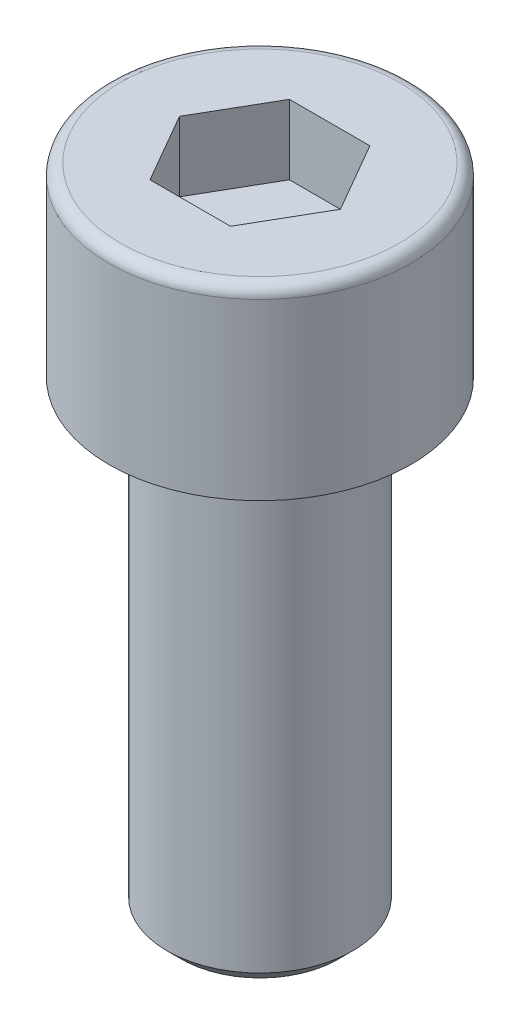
ISO-10303-21;
HEADER;
FILE_DESCRIPTION(('STEP AP214'),'2;1');
FILE_NAME('part.step','',(''),(''),'','','');
FILE_SCHEMA(('AUTOMOTIVE_DESIGN { 1 0 10303 214 1 1 1 1 }'));
ENDSEC;
DATA;
#1=APPLICATION_CONTEXT('core data for automotive mechanical design processes');
#2=APPLICATION_PROTOCOL_DEFINITION('international standard','automotive_design',2000,#1);
#3=PRODUCT_CONTEXT('',#1,'mechanical');
#4=PRODUCT('Part','Part','',(#3));
#5=PRODUCT_RELATED_PRODUCT_CATEGORY('part','',(#4));
#6=PRODUCT_DEFINITION_FORMATION('','',#4);
#7=PRODUCT_DEFINITION_CONTEXT('part definition',#1,'design');
#8=PRODUCT_DEFINITION('design','',#6,#7);
#9=PRODUCT_DEFINITION_SHAPE('','',#8);
#10=(LENGTH_UNIT() NAMED_UNIT(*) SI_UNIT(.MILLI.,.METRE.));
#11=(NAMED_UNIT(*) PLANE_ANGLE_UNIT() SI_UNIT($,.RADIAN.));
#12=(NAMED_UNIT(*) SI_UNIT($,.STERADIAN.) SOLID_ANGLE_UNIT());
#13=UNCERTAINTY_MEASURE_WITH_UNIT(LENGTH_MEASURE(1.E-05),#10,'distance_accuracy_value','');
#14=(GEOMETRIC_REPRESENTATION_CONTEXT(3) GLOBAL_UNCERTAINTY_ASSIGNED_CONTEXT((#13)) GLOBAL_UNIT_ASSIGNED_CONTEXT((#10,
#11,#12)) REPRESENTATION_CONTEXT('',''));
#15=CARTESIAN_POINT('',(0.,0.,0.));
#16=DIRECTION('',(0.,0.,1.));
#17=DIRECTION('',(1.,0.,0.));
#18=AXIS2_PLACEMENT_3D('',#15,#16,#17);
#19=CARTESIAN_POINT('',(-4.00000000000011,0.,4.9960036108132E-13));
#20=DIRECTION('',(0.,-1.,0.));
#21=DIRECTION('',(0.,0.,-1.00000000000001));
#22=AXIS2_PLACEMENT_3D('',#19,#20,#21);
#23=PLANE('',#22);
#24=CARTESIAN_POINT('',(0.,0.,0.));
#25=DIRECTION('',(0.,-1.,0.));
#26=DIRECTION('',(0.,0.,-1.00000000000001));
#27=AXIS2_PLACEMENT_3D('',#24,#25,#26);
#28=CIRCLE('',#27,3.375);
#29=CARTESIAN_POINT('',(0.,0.,-3.37500000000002));
#30=VERTEX_POINT('',#29);
#31=EDGE_CURVE('E11',#30,#30,#28,.T.);
#32=ORIENTED_EDGE('',*,*,#31,.T.);
#33=EDGE_LOOP('',(#32));
#34=FACE_BOUND('',#33,.T.);
#35=ADVANCED_FACE('F28',(#34),#23,.T.);
#36=CARTESIAN_POINT('',(5.55111512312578E-13,49.9999999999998,-3.33066907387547E-13));
#37=DIRECTION('',(0.,1.,0.));
#38=DIRECTION('',(0.,0.,1.00000000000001));
#39=AXIS2_PLACEMENT_3D('',#36,#37,#38);
#40=CYLINDRICAL_SURFACE('',#39,4.00000000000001);
#41=CARTESIAN_POINT('',(0.,0.624999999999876,0.));
#42=DIRECTION('',(0.,-1.,0.));
#43=DIRECTION('',(0.,0.,-1.00000000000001));
#44=AXIS2_PLACEMENT_3D('',#41,#42,#43);
#45=CIRCLE('',#44,4.00000000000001);
#46=CARTESIAN_POINT('',(0.,0.624999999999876,-4.00000000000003));
#47=VERTEX_POINT('',#46);
#48=EDGE_CURVE('E35',#47,#47,#45,.F.);
#49=ORIENTED_EDGE('',*,*,#48,.T.);
#50=EDGE_LOOP('',(#49));
#51=FACE_BOUND('',#50,.T.);
#52=CARTESIAN_POINT('',(-9.99200722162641E-13,20.,3.33066907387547E-13));
#53=DIRECTION('',(0.,1.,0.));
#54=DIRECTION('',(0.,0.,1.00000000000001));
#55=AXIS2_PLACEMENT_3D('',#52,#53,#54);
#56=CIRCLE('',#55,4.);
#57=CARTESIAN_POINT('',(-9.9475983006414E-13,20.,4.00000000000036));
#58=VERTEX_POINT('',#57);
#59=EDGE_CURVE('E145',#58,#58,#56,.T.);
#60=ORIENTED_EDGE('',*,*,#59,.F.);
#61=EDGE_LOOP('',(#60));
#62=FACE_BOUND('',#61,.T.);
#63=ADVANCED_FACE('F150',(#51,#62),#40,.T.);
#64=CARTESIAN_POINT('',(-6.50000000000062,20.,1.0547118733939E-12));
#65=DIRECTION('',(0.,-1.,0.));
#66=DIRECTION('',(0.,0.,-1.00000000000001));
#67=AXIS2_PLACEMENT_3D('',#64,#65,#66);
#68=PLANE('',#67);
#69=ORIENTED_EDGE('',*,*,#59,.T.);
#70=EDGE_LOOP('',(#69));
#71=FACE_BOUND('',#70,.T.);
#72=CARTESIAN_POINT('',(-9.99200722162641E-13,20.,3.33066907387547E-13));
#73=DIRECTION('',(0.,1.,0.));
#74=DIRECTION('',(0.,0.,1.00000000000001));
#75=AXIS2_PLACEMENT_3D('',#72,#73,#74);
#76=CIRCLE('',#75,6.5);
#77=CARTESIAN_POINT('',(-9.91984272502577E-13,20.,6.50000000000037));
#78=VERTEX_POINT('',#77);
#79=EDGE_CURVE('E142',#78,#78,#76,.T.);
#80=ORIENTED_EDGE('',*,*,#79,.F.);
#81=EDGE_LOOP('',(#80));
#82=FACE_BOUND('',#81,.T.);
#83=ADVANCED_FACE('F172',(#71,#82),#68,.T.);
#84=CARTESIAN_POINT('',(5.55111512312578E-13,49.9999999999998,-3.33066907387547E-13));
#85=DIRECTION('',(0.,1.,0.));
#86=DIRECTION('',(0.,0.,1.00000000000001));
#87=AXIS2_PLACEMENT_3D('',#84,#85,#86);
#88=CYLINDRICAL_SURFACE('',#87,6.5);
#89=ORIENTED_EDGE('',*,*,#79,.T.);
#90=EDGE_LOOP('',(#89));
#91=FACE_BOUND('',#90,.T.);
#92=CARTESIAN_POINT('',(-9.99200722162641E-13,27.4999999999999,3.33066907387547E-13));
#93=DIRECTION('',(0.,1.,0.));
#94=DIRECTION('',(0.,0.,1.00000000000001));
#95=AXIS2_PLACEMENT_3D('',#92,#93,#94);
#96=CIRCLE('',#95,6.5);
#97=CARTESIAN_POINT('',(-9.91984272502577E-13,27.4999999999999,6.50000000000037));
#98=VERTEX_POINT('',#97);
#99=EDGE_CURVE('E139',#98,#98,#96,.T.);
#100=ORIENTED_EDGE('',*,*,#99,.F.);
#101=EDGE_LOOP('',(#100));
#102=FACE_BOUND('',#101,.T.);
#103=ADVANCED_FACE('F176',(#91,#102),#88,.T.);
#104=CARTESIAN_POINT('',(-9.99200722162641E-13,27.4999999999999,3.33066907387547E-13));
#105=DIRECTION('',(0.,1.,0.));
#106=DIRECTION('',(0.,0.,1.00000000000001));
#107=AXIS2_PLACEMENT_3D('',#104,#105,#106);
#108=TOROIDAL_SURFACE('',#107,6.,0.5);
#109=CARTESIAN_POINT('',(-9.99200722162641E-13,28.,3.33066907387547E-13));
#110=DIRECTION('',(0.,1.,0.));
#111=DIRECTION('',(0.,0.,1.00000000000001));
#112=AXIS2_PLACEMENT_3D('',#109,#110,#111);
#113=CIRCLE('',#112,6.);
#114=CARTESIAN_POINT('',(-9.9253938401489E-13,28.,6.00000000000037));
#115=VERTEX_POINT('',#114);
#116=EDGE_CURVE('E130',#115,#115,#113,.T.);
#117=ORIENTED_EDGE('',*,*,#116,.F.);
#118=EDGE_LOOP('',(#117));
#119=FACE_BOUND('',#118,.T.);
#120=ORIENTED_EDGE('',*,*,#99,.T.);
#121=EDGE_LOOP('',(#120));
#122=FACE_BOUND('',#121,.T.);
#123=ADVANCED_FACE('F164',(#119,#122),#108,.T.);
#124=CARTESIAN_POINT('',(-9.99200722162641E-13,28.,3.33066907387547E-13));
#125=DIRECTION('',(0.,1.,0.));
#126=DIRECTION('',(0.,0.,1.00000000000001));
#127=AXIS2_PLACEMENT_3D('',#124,#125,#126);
#128=PLANE('',#127);
#129=DIRECTION('',(-0.500000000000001,0.,0.866025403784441));
#130=VECTOR('',#129,1.);
#131=CARTESIAN_POINT('',(-1.73205080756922,28.,-2.99999999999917));
#132=LINE('',#131,#130);
#133=CARTESIAN_POINT('',(-1.73205080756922,28.,-2.99999999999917));
#134=VERTEX_POINT('',#133);
#135=CARTESIAN_POINT('',(-3.46410161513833,28.,8.32667268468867E-13));
#136=VERTEX_POINT('',#135);
#137=EDGE_CURVE('E42',#134,#136,#132,.T.);
#138=ORIENTED_EDGE('',*,*,#137,.F.);
#139=DIRECTION('',(-1.,0.,0.));
#140=VECTOR('',#139,1.);
#141=CARTESIAN_POINT('',(1.73205080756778,28.,-2.99999999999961));
#142=LINE('',#141,#140);
#143=CARTESIAN_POINT('',(1.73205080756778,28.,-2.99999999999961));
#144=VERTEX_POINT('',#143);
#145=EDGE_CURVE('E112',#144,#134,#142,.T.);
#146=ORIENTED_EDGE('',*,*,#145,.F.);
#147=DIRECTION('',(-0.500000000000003,0.,-0.866025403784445));
#148=VECTOR('',#147,1.);
#149=CARTESIAN_POINT('',(3.46410161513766,28.0000000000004,9.99200722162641E-13));
#150=LINE('',#149,#148);
#151=CARTESIAN_POINT('',(3.46410161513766,28.0000000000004,9.99200722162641E-13));
#152=VERTEX_POINT('',#151);
#153=EDGE_CURVE('E106',#152,#144,#150,.T.);
#154=ORIENTED_EDGE('',*,*,#153,.F.);
#155=DIRECTION('',(0.500000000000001,0.,-0.866025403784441));
#156=VECTOR('',#155,1.);
#157=CARTESIAN_POINT('',(1.73205080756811,28.0000000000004,3.00000000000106));
#158=LINE('',#157,#156);
#159=CARTESIAN_POINT('',(1.73205080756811,28.0000000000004,3.00000000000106));
#160=VERTEX_POINT('',#159);
#161=EDGE_CURVE('E104',#160,#152,#158,.T.);
#162=ORIENTED_EDGE('',*,*,#161,.F.);
#163=DIRECTION('',(1.,0.,0.));
#164=VECTOR('',#163,1.);
#165=CARTESIAN_POINT('',(-1.73205080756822,28.,3.00000000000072));
#166=LINE('',#165,#164);
#167=CARTESIAN_POINT('',(-1.73205080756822,28.,3.00000000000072));
#168=VERTEX_POINT('',#167);
#169=EDGE_CURVE('E85',#168,#160,#166,.T.);
#170=ORIENTED_EDGE('',*,*,#169,.F.);
#171=DIRECTION('',(0.500000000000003,0.,0.866025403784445));
#172=VECTOR('',#171,1.);
#173=CARTESIAN_POINT('',(-3.46410161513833,28.,8.32667268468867E-13));
#174=LINE('',#173,#172);
#175=EDGE_CURVE('E96',#136,#168,#174,.T.);
#176=ORIENTED_EDGE('',*,*,#175,.F.);
#177=EDGE_LOOP('',(#138,#146,#154,#162,#170,#176));
#178=FACE_BOUND('',#177,.T.);
#179=ORIENTED_EDGE('',*,*,#116,.T.);
#180=EDGE_LOOP('',(#179));
#181=FACE_BOUND('',#180,.T.);
#182=ADVANCED_FACE('F100',(#178,#181),#128,.T.);
#183=CARTESIAN_POINT('',(0.,0.624999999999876,0.));
#184=DIRECTION('',(0.,1.,0.));
#185=DIRECTION('',(0.,0.,1.00000000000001));
#186=AXIS2_PLACEMENT_3D('',#183,#184,#185);
#187=CONICAL_SURFACE('',#186,4.00000000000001,0.78539816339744);
#188=ORIENTED_EDGE('',*,*,#31,.F.);
#189=EDGE_LOOP('',(#188));
#190=FACE_BOUND('',#189,.T.);
#191=ORIENTED_EDGE('',*,*,#48,.F.);
#192=EDGE_LOOP('',(#191));
#193=FACE_BOUND('',#192,.T.);
#194=ADVANCED_FACE('F153',(#190,#193),#187,.T.);
#195=CARTESIAN_POINT('',(-1.73205080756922,24.9999999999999,-2.99999999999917));
#196=DIRECTION('',(-0.866025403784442,0.,-0.500000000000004));
#197=DIRECTION('',(-0.500000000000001,0.,0.866025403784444));
#198=AXIS2_PLACEMENT_3D('',#195,#196,#197);
#199=PLANE('',#198);
#200=ORIENTED_EDGE('',*,*,#137,.T.);
#201=DIRECTION('',(0.,1.,0.));
#202=VECTOR('',#201,1.);
#203=CARTESIAN_POINT('',(-3.46410161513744,24.9999999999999,4.9960036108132E-13));
#204=LINE('',#203,#202);
#205=CARTESIAN_POINT('',(-3.46410161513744,24.9999999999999,4.9960036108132E-13));
#206=VERTEX_POINT('',#205);
#207=EDGE_CURVE('E93',#206,#136,#204,.T.);
#208=ORIENTED_EDGE('',*,*,#207,.F.);
#209=DIRECTION('',(-0.500000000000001,0.,0.866025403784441));
#210=VECTOR('',#209,1.);
#211=CARTESIAN_POINT('',(-1.73205080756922,24.9999999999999,-2.99999999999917));
#212=LINE('',#211,#210);
#213=CARTESIAN_POINT('',(-1.73205080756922,24.9999999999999,-2.99999999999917));
#214=VERTEX_POINT('',#213);
#215=EDGE_CURVE('E114',#214,#206,#212,.T.);
#216=ORIENTED_EDGE('',*,*,#215,.F.);
#217=DIRECTION('',(0.,1.,0.));
#218=VECTOR('',#217,1.);
#219=CARTESIAN_POINT('',(-1.73205080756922,24.9999999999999,-2.99999999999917));
#220=LINE('',#219,#218);
#221=EDGE_CURVE('E49',#214,#134,#220,.T.);
#222=ORIENTED_EDGE('',*,*,#221,.T.);
#223=EDGE_LOOP('',(#200,#208,#216,#222));
#224=FACE_BOUND('',#223,.T.);
#225=ADVANCED_FACE('F155',(#224),#199,.F.);
#226=CARTESIAN_POINT('',(1.73205080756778,24.9999999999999,-2.99999999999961));
#227=DIRECTION('',(0.,0.,-1.00000000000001));
#228=DIRECTION('',(-1.,0.,0.));
#229=AXIS2_PLACEMENT_3D('',#226,#227,#228);
#230=PLANE('',#229);
#231=ORIENTED_EDGE('',*,*,#145,.T.);
#232=ORIENTED_EDGE('',*,*,#221,.F.);
#233=DIRECTION('',(-1.,0.,0.));
#234=VECTOR('',#233,1.);
#235=CARTESIAN_POINT('',(1.73205080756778,24.9999999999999,-2.99999999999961));
#236=LINE('',#235,#234);
#237=CARTESIAN_POINT('',(1.73205080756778,24.9999999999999,-2.99999999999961));
#238=VERTEX_POINT('',#237);
#239=EDGE_CURVE('E126',#238,#214,#236,.T.);
#240=ORIENTED_EDGE('',*,*,#239,.F.);
#241=DIRECTION('',(0.,1.,0.));
#242=VECTOR('',#241,1.);
#243=CARTESIAN_POINT('',(1.73205080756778,24.9999999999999,-2.99999999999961));
#244=LINE('',#243,#242);
#245=EDGE_CURVE('E131',#238,#144,#244,.T.);
#246=ORIENTED_EDGE('',*,*,#245,.T.);
#247=EDGE_LOOP('',(#231,#232,#240,#246));
#248=FACE_BOUND('',#247,.T.);
#249=ADVANCED_FACE('F162',(#248),#230,.F.);
#250=CARTESIAN_POINT('',(3.46410161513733,25.0000000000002,9.43689570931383E-13));
#251=DIRECTION('',(0.866025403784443,0.,-0.500000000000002));
#252=DIRECTION('',(-0.500000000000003,0.,-0.866025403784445));
#253=AXIS2_PLACEMENT_3D('',#250,#251,#252);
#254=PLANE('',#253);
#255=ORIENTED_EDGE('',*,*,#153,.T.);
#256=ORIENTED_EDGE('',*,*,#245,.F.);
#257=DIRECTION('',(-0.500000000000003,0.,-0.866025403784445));
#258=VECTOR('',#257,1.);
#259=CARTESIAN_POINT('',(3.46410161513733,25.0000000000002,9.43689570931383E-13));
#260=LINE('',#259,#258);
#261=CARTESIAN_POINT('',(3.46410161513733,25.0000000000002,9.43689570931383E-13));
#262=VERTEX_POINT('',#261);
#263=EDGE_CURVE('E123',#262,#238,#260,.T.);
#264=ORIENTED_EDGE('',*,*,#263,.F.);
#265=DIRECTION('',(0.,1.,0.));
#266=VECTOR('',#265,1.);
#267=CARTESIAN_POINT('',(3.46410161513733,25.0000000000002,9.43689570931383E-13));
#268=LINE('',#267,#266);
#269=EDGE_CURVE('E133',#262,#152,#268,.T.);
#270=ORIENTED_EDGE('',*,*,#269,.T.);
#271=EDGE_LOOP('',(#255,#256,#264,#270));
#272=FACE_BOUND('',#271,.T.);
#273=ADVANCED_FACE('F212',(#272),#254,.F.);
#274=CARTESIAN_POINT('',(1.73205080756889,25.0000000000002,3.000000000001));
#275=DIRECTION('',(0.866025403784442,0.,0.500000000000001));
#276=DIRECTION('',(0.500000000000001,0.,-0.866025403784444));
#277=AXIS2_PLACEMENT_3D('',#274,#275,#276);
#278=PLANE('',#277);
#279=ORIENTED_EDGE('',*,*,#161,.T.);
#280=ORIENTED_EDGE('',*,*,#269,.F.);
#281=DIRECTION('',(0.500000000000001,0.,-0.866025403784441));
#282=VECTOR('',#281,1.);
#283=CARTESIAN_POINT('',(1.73205080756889,25.0000000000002,3.000000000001));
#284=LINE('',#283,#282);
#285=CARTESIAN_POINT('',(1.73205080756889,25.0000000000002,3.000000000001));
#286=VERTEX_POINT('',#285);
#287=EDGE_CURVE('E120',#286,#262,#284,.T.);
#288=ORIENTED_EDGE('',*,*,#287,.F.);
#289=DIRECTION('',(0.,1.,0.));
#290=VECTOR('',#289,1.);
#291=CARTESIAN_POINT('',(1.73205080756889,25.0000000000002,3.000000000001));
#292=LINE('',#291,#290);
#293=EDGE_CURVE('E92',#286,#160,#292,.T.);
#294=ORIENTED_EDGE('',*,*,#293,.T.);
#295=EDGE_LOOP('',(#279,#280,#288,#294));
#296=FACE_BOUND('',#295,.T.);
#297=ADVANCED_FACE('F219',(#296),#278,.F.);
#298=CARTESIAN_POINT('',(-1.73205080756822,24.9999999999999,3.00000000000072));
#299=DIRECTION('',(0.,0.,1.00000000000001));
#300=DIRECTION('',(1.,0.,0.));
#301=AXIS2_PLACEMENT_3D('',#298,#299,#300);
#302=PLANE('',#301);
#303=ORIENTED_EDGE('',*,*,#169,.T.);
#304=ORIENTED_EDGE('',*,*,#293,.F.);
#305=DIRECTION('',(1.,0.,0.));
#306=VECTOR('',#305,1.);
#307=CARTESIAN_POINT('',(-1.73205080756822,24.9999999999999,3.00000000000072));
#308=LINE('',#307,#306);
#309=CARTESIAN_POINT('',(-1.73205080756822,24.9999999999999,3.00000000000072));
#310=VERTEX_POINT('',#309);
#311=EDGE_CURVE('E88',#310,#286,#308,.T.);
#312=ORIENTED_EDGE('',*,*,#311,.F.);
#313=DIRECTION('',(0.,1.,0.));
#314=VECTOR('',#313,1.);
#315=CARTESIAN_POINT('',(-1.73205080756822,24.9999999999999,3.00000000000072));
#316=LINE('',#315,#314);
#317=EDGE_CURVE('E81',#310,#168,#316,.T.);
#318=ORIENTED_EDGE('',*,*,#317,.T.);
#319=EDGE_LOOP('',(#303,#304,#312,#318));
#320=FACE_BOUND('',#319,.T.);
#321=ADVANCED_FACE('F83',(#320),#302,.F.);
#322=CARTESIAN_POINT('',(-3.46410161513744,24.9999999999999,4.9960036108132E-13));
#323=DIRECTION('',(-0.866025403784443,0.,0.500000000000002));
#324=DIRECTION('',(0.500000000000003,0.,0.866025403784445));
#325=AXIS2_PLACEMENT_3D('',#322,#323,#324);
#326=PLANE('',#325);
#327=ORIENTED_EDGE('',*,*,#175,.T.);
#328=ORIENTED_EDGE('',*,*,#317,.F.);
#329=DIRECTION('',(0.500000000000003,0.,0.866025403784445));
#330=VECTOR('',#329,1.);
#331=CARTESIAN_POINT('',(-3.46410161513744,24.9999999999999,4.9960036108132E-13));
#332=LINE('',#331,#330);
#333=EDGE_CURVE('E117',#206,#310,#332,.T.);
#334=ORIENTED_EDGE('',*,*,#333,.F.);
#335=ORIENTED_EDGE('',*,*,#207,.T.);
#336=EDGE_LOOP('',(#327,#328,#334,#335));
#337=FACE_BOUND('',#336,.T.);
#338=ADVANCED_FACE('F97',(#337),#326,.F.);
#339=CARTESIAN_POINT('',(-1.73205080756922,24.9999999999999,-2.99999999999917));
#340=DIRECTION('',(0.,-1.,0.));
#341=DIRECTION('',(0.,0.,-1.00000000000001));
#342=AXIS2_PLACEMENT_3D('',#339,#340,#341);
#343=PLANE('',#342);
#344=ORIENTED_EDGE('',*,*,#215,.T.);
#345=ORIENTED_EDGE('',*,*,#333,.T.);
#346=ORIENTED_EDGE('',*,*,#311,.T.);
#347=ORIENTED_EDGE('',*,*,#287,.T.);
#348=ORIENTED_EDGE('',*,*,#263,.T.);
#349=ORIENTED_EDGE('',*,*,#239,.T.);
#350=EDGE_LOOP('',(#344,#345,#346,#347,#348,#349));
#351=FACE_BOUND('',#350,.T.);
#352=ADVANCED_FACE('F240',(#351),#343,.F.);
#353=CLOSED_SHELL('',(#35,#63,#83,#103,#123,#182,#194,#225,#249,#273,#297,#321,#338,#352));
#354=MANIFOLD_SOLID_BREP('B2',#353);
#355=ADVANCED_BREP_SHAPE_REPRESENTATION('',(#18,#354),#14);
#356=SHAPE_DEFINITION_REPRESENTATION(#9,#355);
ENDSEC;
END-ISO-10303-21;
